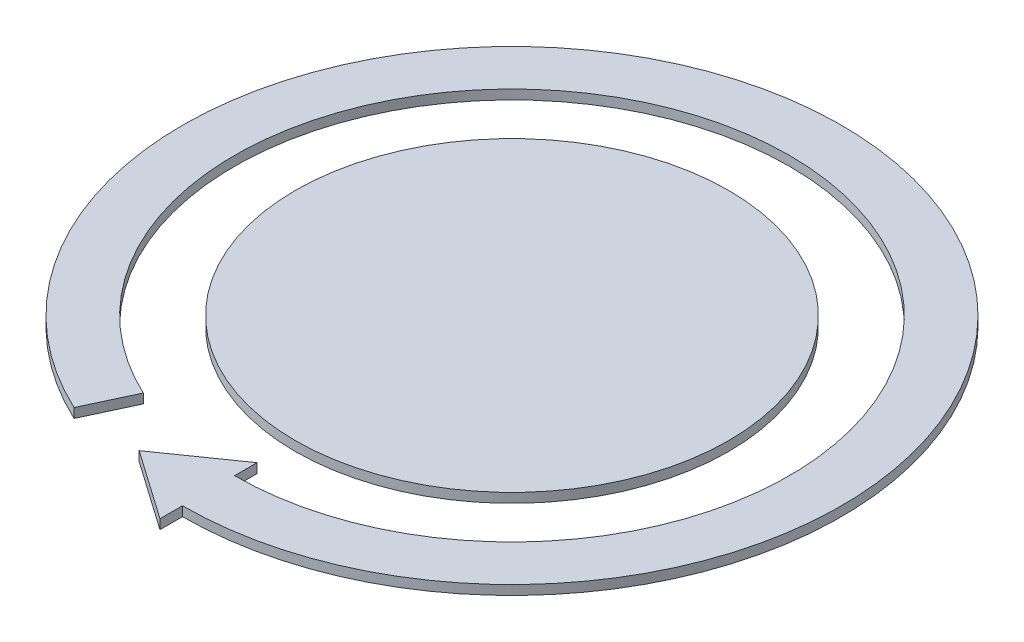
from build123d import *

# Parameters (mm, degrees)
SKIZZE1_R                         = 45.75
AUFSATZ_LINEAR_AUSTRAGEN1_DEPTH   = 2
AUFSATZ_LINEAR_AUSTRAGEN1_2_DEPTH = 2


with BuildPart() as part:
    # Skizze1 → Aufsatz-Linear austragen1 (new body)
    with BuildSketch(Plane(origin=(0, 0, 0), x_dir=(-1, 0, 0), z_dir=(0, 1, 0))):
        with Locations(Location((0, 0, 0), (0, 0, 90))):
            Circle(SKIZZE1_R)
    extrude(amount=AUFSATZ_LINEAR_AUSTRAGEN1_DEPTH)


with BuildPart() as body_2:
    # Skizze1 → Aufsatz-Linear austragen1 2 (new body)
    with BuildSketch(Plane(origin=(0, 0, 0), x_dir=(-1, 0, 0), z_dir=(0, 1, 0))):
        with BuildLine():
            Line((0, 74.323364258), (0, 69.575))
            ThreePointArc((0, 69.575), (-15.058715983, -67.925810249), (29.403535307, 63.056425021))
            Line((29.403535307, 63.056425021), (24.754755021, 53.087029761))
            ThreePointArc((24.754755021, 53.087029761), (-12.677891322, -57.186551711), (0, 58.575))
            Line((0, 58.575), (0, 53.82043457))
            Line((0, 53.82043457), (14.640609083, 64.071899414))
            Line((14.640609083, 64.071899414), (0, 74.323364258))
        make_face()
    extrude(amount=AUFSATZ_LINEAR_AUSTRAGEN1_2_DEPTH)


solid = Compound([part.part, body_2.part])
